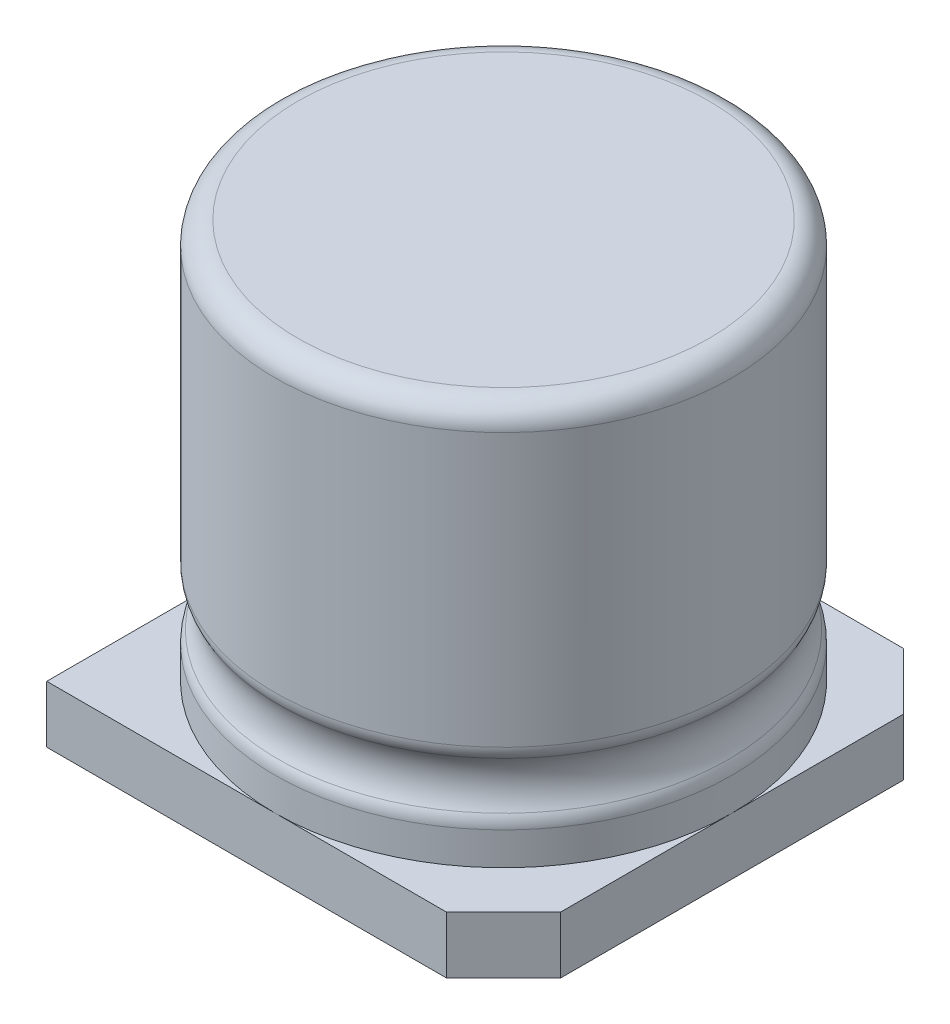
ISO-10303-21;
HEADER;
FILE_DESCRIPTION(('STEP AP214'),'2;1');
FILE_NAME('part.step','',(''),(''),'','','');
FILE_SCHEMA(('AUTOMOTIVE_DESIGN { 1 0 10303 214 1 1 1 1 }'));
ENDSEC;
DATA;
#1=APPLICATION_CONTEXT('core data for automotive mechanical design processes');
#2=APPLICATION_PROTOCOL_DEFINITION('international standard','automotive_design',2000,#1);
#3=PRODUCT_CONTEXT('',#1,'mechanical');
#4=PRODUCT('Part','Part','',(#3));
#5=PRODUCT_RELATED_PRODUCT_CATEGORY('part','',(#4));
#6=PRODUCT_DEFINITION_FORMATION('','',#4);
#7=PRODUCT_DEFINITION_CONTEXT('part definition',#1,'design');
#8=PRODUCT_DEFINITION('design','',#6,#7);
#9=PRODUCT_DEFINITION_SHAPE('','',#8);
#10=(LENGTH_UNIT() NAMED_UNIT(*) SI_UNIT(.MILLI.,.METRE.));
#11=(NAMED_UNIT(*) PLANE_ANGLE_UNIT() SI_UNIT($,.RADIAN.));
#12=(NAMED_UNIT(*) SI_UNIT($,.STERADIAN.) SOLID_ANGLE_UNIT());
#13=UNCERTAINTY_MEASURE_WITH_UNIT(LENGTH_MEASURE(1.E-05),#10,'distance_accuracy_value','');
#14=(GEOMETRIC_REPRESENTATION_CONTEXT(3) GLOBAL_UNCERTAINTY_ASSIGNED_CONTEXT((#13)) GLOBAL_UNIT_ASSIGNED_CONTEXT((#10,
#11,#12)) REPRESENTATION_CONTEXT('',''));
#15=CARTESIAN_POINT('',(0.,0.,0.));
#16=DIRECTION('',(0.,0.,1.));
#17=DIRECTION('',(1.,0.,0.));
#18=AXIS2_PLACEMENT_3D('',#15,#16,#17);
#19=CARTESIAN_POINT('',(18.21688,10.414,-20.7568799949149));
#20=DIRECTION('',(0.,1.,0.));
#21=DIRECTION('',(-1.,0.,0.));
#22=AXIS2_PLACEMENT_3D('',#19,#20,#21);
#23=PLANE('',#22);
#24=CARTESIAN_POINT('',(18.0340000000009,10.414,-16.0020000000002));
#25=CARTESIAN_POINT('',(18.0340001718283,10.414,-15.9747971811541));
#26=CARTESIAN_POINT('',(18.0337574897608,10.4139999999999,-15.9475943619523));
#27=CARTESIAN_POINT('',(18.0327866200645,10.4139999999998,-15.8931973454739));
#28=CARTESIAN_POINT('',(18.0320584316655,10.4139999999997,-15.8660031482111));
#29=CARTESIAN_POINT('',(18.0301167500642,10.4139999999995,-15.8116320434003));
#30=CARTESIAN_POINT('',(18.0289032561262,10.4139999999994,-15.7844551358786));
#31=CARTESIAN_POINT('',(18.0259913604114,10.4139999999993,-15.7301272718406));
#32=CARTESIAN_POINT('',(18.0242929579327,10.4139999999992,-15.7029763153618));
#33=CARTESIAN_POINT('',(18.0204117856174,10.4139999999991,-15.6487090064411));
#34=CARTESIAN_POINT('',(18.0182290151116,10.4139999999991,-15.621592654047));
#35=CARTESIAN_POINT('',(18.0133798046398,10.4139999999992,-15.567403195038));
#36=CARTESIAN_POINT('',(18.0107133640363,10.4139999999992,-15.5403300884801));
#37=CARTESIAN_POINT('',(18.004897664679,10.4139999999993,-15.4862357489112));
#38=CARTESIAN_POINT('',(18.0017484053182,10.4139999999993,-15.4592145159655));
#39=CARTESIAN_POINT('',(17.9949680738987,10.4139999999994,-15.4052325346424));
#40=CARTESIAN_POINT('',(17.9913370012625,10.4139999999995,-15.3782717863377));
#41=CARTESIAN_POINT('',(17.9835942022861,10.4139999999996,-15.3244193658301));
#42=CARTESIAN_POINT('',(17.979482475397,10.4139999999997,-15.2975276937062));
#43=CARTESIAN_POINT('',(17.9707796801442,10.4139999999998,-15.2438219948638));
#44=CARTESIAN_POINT('',(17.9661886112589,10.4139999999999,-15.2170079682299));
#45=CARTESIAN_POINT('',(17.9565285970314,10.4139999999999,-15.1634661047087));
#46=CARTESIAN_POINT('',(17.9514596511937,10.414,-15.1367382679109));
#47=CARTESIAN_POINT('',(17.9408455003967,10.414,-15.0833773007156));
#48=CARTESIAN_POINT('',(17.9353002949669,10.414,-15.0567441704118));
#49=CARTESIAN_POINT('',(17.9237353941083,10.414,-15.0035811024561));
#50=CARTESIAN_POINT('',(17.917715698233,10.414,-14.9770511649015));
#51=CARTESIAN_POINT('',(17.9052037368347,10.4139999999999,-14.9241029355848));
#52=CARTESIAN_POINT('',(17.8987114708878,10.4139999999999,-14.897684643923));
#53=CARTESIAN_POINT('',(17.8852564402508,10.4139999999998,-14.8449681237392));
#54=CARTESIAN_POINT('',(17.8782936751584,10.4139999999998,-14.8186698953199));
#55=CARTESIAN_POINT('',(17.8638998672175,10.4139999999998,-14.7662018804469));
#56=CARTESIAN_POINT('',(17.8564688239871,10.4139999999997,-14.7400320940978));
#57=CARTESIAN_POINT('',(17.8411408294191,10.4139999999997,-14.6878293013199));
#58=CARTESIAN_POINT('',(17.8332438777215,10.4139999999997,-14.6617962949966));
#59=CARTESIAN_POINT('',(17.8169865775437,10.4139999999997,-14.609875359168));
#60=CARTESIAN_POINT('',(17.8086262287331,10.4139999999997,-14.583987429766));
#61=CARTESIAN_POINT('',(17.7914447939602,10.4139999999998,-14.5323648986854));
#62=CARTESIAN_POINT('',(17.7826237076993,10.4139999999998,-14.5066302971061));
#63=CARTESIAN_POINT('',(17.7645236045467,10.4139999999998,-14.4553226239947));
#64=CARTESIAN_POINT('',(17.755244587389,10.4139999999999,-14.4297495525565));
#65=CARTESIAN_POINT('',(17.7362315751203,10.4139999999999,-14.378773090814));
#66=CARTESIAN_POINT('',(17.7264975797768,10.4139999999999,-14.3533697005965));
#67=CARTESIAN_POINT('',(17.7065777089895,10.414,-14.3027406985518));
#68=CARTESIAN_POINT('',(17.6963918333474,10.414,-14.2775150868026));
#69=CARTESIAN_POINT('',(17.6755714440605,10.414,-14.2272496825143));
#70=CARTESIAN_POINT('',(17.6649369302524,10.414,-14.2022098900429));
#71=CARTESIAN_POINT('',(17.6432226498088,10.414,-14.1523241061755));
#72=CARTESIAN_POINT('',(17.6321428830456,10.414,-14.1274781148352));
#73=CARTESIAN_POINT('',(17.6095416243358,10.414,-14.0779878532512));
#74=CARTESIAN_POINT('',(17.598020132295,10.414,-14.0533435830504));
#75=CARTESIAN_POINT('',(17.5745390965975,10.414,-14.0042646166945));
#76=CARTESIAN_POINT('',(17.5625795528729,10.414,-13.9798299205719));
#77=CARTESIAN_POINT('',(17.5382262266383,10.414,-13.9311778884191));
#78=CARTESIAN_POINT('',(17.5258324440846,10.414,-13.9069605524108));
#79=CARTESIAN_POINT('',(17.5006145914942,10.414,-13.8587509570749));
#80=CARTESIAN_POINT('',(17.4877905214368,10.414,-13.8347586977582));
#81=CARTESIAN_POINT('',(17.4617161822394,10.414,-13.7870069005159));
#82=CARTESIAN_POINT('',(17.4484659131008,10.414,-13.7632473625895));
#83=CARTESIAN_POINT('',(17.4215433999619,10.414,-13.7159685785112));
#84=CARTESIAN_POINT('',(17.407871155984,10.414,-13.6924493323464));
#85=CARTESIAN_POINT('',(17.3801090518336,10.414,-13.6456586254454));
#86=CARTESIAN_POINT('',(17.3660191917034,10.414,-13.6223871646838));
#87=CARTESIAN_POINT('',(17.3374263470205,10.414,-13.5760994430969));
#88=CARTESIAN_POINT('',(17.3229233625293,10.414,-13.5530831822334));
#89=CARTESIAN_POINT('',(17.2935088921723,10.414,-13.5073131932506));
#90=CARTESIAN_POINT('',(17.2785974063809,10.414,-13.4845594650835));
#91=CARTESIAN_POINT('',(17.2483706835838,10.414,-13.4393217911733));
#92=CARTESIAN_POINT('',(17.2330554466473,10.414,-13.4168378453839));
#93=CARTESIAN_POINT('',(17.2020261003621,10.414,-13.3721468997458));
#94=CARTESIAN_POINT('',(17.1863119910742,10.414,-13.3499398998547));
#95=CARTESIAN_POINT('',(17.154489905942,10.414,-13.3058099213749));
#96=CARTESIAN_POINT('',(17.1383819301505,10.414,-13.2838869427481));
#97=CARTESIAN_POINT('',(17.1057772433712,10.414,-13.2403319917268));
#98=CARTESIAN_POINT('',(17.0892805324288,10.414,-13.2187000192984));
#99=CARTESIAN_POINT('',(17.0559036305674,10.414,-13.1757339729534));
#100=CARTESIAN_POINT('',(17.0390234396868,10.414,-13.1543998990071));
#101=CARTESIAN_POINT('',(17.0048849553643,10.414,-13.1120364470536));
#102=CARTESIAN_POINT('',(16.987626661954,10.414,-13.0910070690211));
#103=CARTESIAN_POINT('',(16.9527374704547,10.414,-13.049259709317));
#104=CARTESIAN_POINT('',(16.9351065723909,10.414,-13.0285417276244));
#105=CARTESIAN_POINT('',(16.8994777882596,10.414,-12.9874237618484));
#106=CARTESIAN_POINT('',(16.8814799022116,10.414,-12.9670237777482));
#107=CARTESIAN_POINT('',(16.8451228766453,10.414,-12.926548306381));
#108=CARTESIAN_POINT('',(16.8267637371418,10.414,-12.9064728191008));
#109=CARTESIAN_POINT('',(16.7896900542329,10.414,-12.8666527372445));
#110=CARTESIAN_POINT('',(16.7709755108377,10.414,-12.8469081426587));
#111=CARTESIAN_POINT('',(16.7331969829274,10.414,-12.8077561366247));
#112=CARTESIAN_POINT('',(16.7141329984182,10.414,-12.7883487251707));
#113=CARTESIAN_POINT('',(16.675661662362,10.414,-12.7498772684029));
#114=CARTESIAN_POINT('',(16.6562543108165,10.414,-12.7308132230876));
#115=CARTESIAN_POINT('',(16.6171024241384,10.414,-12.6930345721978));
#116=CARTESIAN_POINT('',(16.5973578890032,10.414,-12.6743199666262));
#117=CARTESIAN_POINT('',(16.5575379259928,10.414,-12.6372461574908));
#118=CARTESIAN_POINT('',(16.5374624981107,10.414,-12.6188869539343));
#119=CARTESIAN_POINT('',(16.496987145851,10.414,-12.582529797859));
#120=CARTESIAN_POINT('',(16.4765872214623,10.414,-12.5645318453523));
#121=CARTESIAN_POINT('',(16.435469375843,10.414,-12.5289029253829));
#122=CARTESIAN_POINT('',(16.4147514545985,10.414,-12.5112719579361));
#123=CARTESIAN_POINT('',(16.3730042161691,10.414,-12.4763826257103));
#124=CARTESIAN_POINT('',(16.3519748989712,10.414,-12.4591242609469));
#125=CARTESIAN_POINT('',(16.3096115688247,10.414,-12.4249856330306));
#126=CARTESIAN_POINT('',(16.2882775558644,10.414,-12.4081053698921));
#127=CARTESIAN_POINT('',(16.2453116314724,10.414,-12.3747283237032));
#128=CARTESIAN_POINT('',(16.2236797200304,10.414,-12.3582315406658));
#129=CARTESIAN_POINT('',(16.1801248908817,10.414,-12.3256267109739));
#130=CARTESIAN_POINT('',(16.1582019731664,10.414,-12.3095186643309));
#131=CARTESIAN_POINT('',(16.1140721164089,10.414,-12.2776964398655));
#132=CARTESIAN_POINT('',(16.0918651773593,10.414,-12.2619822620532));
#133=CARTESIAN_POINT('',(16.0471743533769,10.414,-12.2309527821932));
#134=CARTESIAN_POINT('',(16.024690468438,10.414,-12.2156374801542));
#135=CARTESIAN_POINT('',(15.9794529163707,10.414,-12.1854106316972));
#136=CARTESIAN_POINT('',(15.9566992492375,10.414,-12.1704990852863));
#137=CARTESIAN_POINT('',(15.9109293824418,10.414,-12.1410844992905));
#138=CARTESIAN_POINT('',(15.8879131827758,10.414,-12.1265814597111));
#139=CARTESIAN_POINT('',(15.8416255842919,10.414,-12.0979885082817));
#140=CARTESIAN_POINT('',(15.8183541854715,10.414,-12.0838985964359));
#141=CARTESIAN_POINT('',(15.7715636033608,10.414,-12.0561363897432));
#142=CARTESIAN_POINT('',(15.7480444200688,10.414,-12.0424640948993));
#143=CARTESIAN_POINT('',(15.7007657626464,10.414,-12.0155414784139));
#144=CARTESIAN_POINT('',(15.6770062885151,10.414,-12.0022911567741));
#145=CARTESIAN_POINT('',(15.6292546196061,10.414,-11.9762167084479));
#146=CARTESIAN_POINT('',(15.6052624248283,10.414,-11.9633925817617));
#147=CARTESIAN_POINT('',(15.557052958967,10.414,-11.9381746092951));
#148=CARTESIAN_POINT('',(15.5328356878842,10.414,-11.9257807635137));
#149=CARTESIAN_POINT('',(15.4841837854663,10.414,-11.9014273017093));
#150=CARTESIAN_POINT('',(15.4597491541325,10.414,-11.8894676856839));
#151=CARTESIAN_POINT('',(15.4106703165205,10.414,-11.8659864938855));
#152=CARTESIAN_POINT('',(15.3860261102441,10.414,-11.8544649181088));
#153=CARTESIAN_POINT('',(15.3365359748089,10.414,-11.8318634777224));
#154=CARTESIAN_POINT('',(15.3116900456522,10.414,-11.8207836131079));
#155=CARTESIAN_POINT('',(15.2618043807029,10.414,-11.7990691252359));
#156=CARTESIAN_POINT('',(15.2367646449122,10.414,-11.788434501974));
#157=CARTESIAN_POINT('',(15.1864993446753,10.414,-11.7676138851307));
#158=CARTESIAN_POINT('',(15.1612737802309,10.414,-11.7574278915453));
#159=CARTESIAN_POINT('',(15.1106448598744,10.414,-11.7375077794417));
#160=CARTESIAN_POINT('',(15.0852415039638,10.414,-11.7277736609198));
#161=CARTESIAN_POINT('',(15.034265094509,10.414,-11.7087604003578));
#162=CARTESIAN_POINT('',(15.0086920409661,10.414,-11.6994812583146));
#163=CARTESIAN_POINT('',(14.9573843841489,10.414,-11.6813809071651));
#164=CARTESIAN_POINT('',(14.9316497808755,10.414,-11.672559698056));
#165=CARTESIAN_POINT('',(14.8800272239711,10.414,-11.6553780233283));
#166=CARTESIAN_POINT('',(14.8541392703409,10.414,-11.6470175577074));
#167=CARTESIAN_POINT('',(14.802218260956,10.414,-11.6307600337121));
#168=CARTESIAN_POINT('',(14.776185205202,10.414,-11.622862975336));
#169=CARTESIAN_POINT('',(14.7239822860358,10.414,-11.607534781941));
#170=CARTESIAN_POINT('',(14.697812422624,10.414,-11.6001036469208));
#171=CARTESIAN_POINT('',(14.645344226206,10.414,-11.5857096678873));
#172=CARTESIAN_POINT('',(14.6190458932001,10.414,-11.5787468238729));
#173=CARTESIAN_POINT('',(14.56632913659,10.414,-11.5652916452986));
#174=CARTESIAN_POINT('',(14.539910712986,10.414,-11.5587993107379));
#175=CARTESIAN_POINT('',(14.4869621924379,10.414,-11.5462872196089));
#176=CARTESIAN_POINT('',(14.4604320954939,10.414,-11.5402674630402));
#177=CARTESIAN_POINT('',(14.4072686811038,10.414,-11.5287024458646));
#178=CARTESIAN_POINT('',(14.3806353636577,10.414,-11.5231571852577));
#179=CARTESIAN_POINT('',(14.3272739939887,10.414,-11.5125429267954));
#180=CARTESIAN_POINT('',(14.3005459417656,10.414,-11.5074739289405));
#181=CARTESIAN_POINT('',(14.2470036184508,10.414,-11.4978138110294));
#182=CARTESIAN_POINT('',(14.220189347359,10.414,-11.4932226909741));
#183=CARTESIAN_POINT('',(14.1664831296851,10.414,-11.4845197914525));
#184=CARTESIAN_POINT('',(14.1395911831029,10.414,-11.4804080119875));
#185=CARTESIAN_POINT('',(14.0857381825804,10.414,-11.4726651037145));
#186=CARTESIAN_POINT('',(14.0587771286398,10.414,-11.469033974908));
#187=CARTESIAN_POINT('',(14.0047945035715,10.414,-11.4622535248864));
#188=CARTESIAN_POINT('',(13.9777729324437,10.414,-11.4591042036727));
#189=CARTESIAN_POINT('',(13.923677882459,10.414,-11.4532883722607));
#190=CARTESIAN_POINT('',(13.8966044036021,10.414,-11.4506218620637));
#191=CARTESIAN_POINT('',(13.8424141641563,10.414,-11.4457725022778));
#192=CARTESIAN_POINT('',(13.8152974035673,10.414,-11.44358965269));
#193=CARTESIAN_POINT('',(13.7610292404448,10.414,-11.4397083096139));
#194=CARTESIAN_POINT('',(13.7338778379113,10.414,-11.4380098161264));
#195=CARTESIAN_POINT('',(13.6795490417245,10.414,-11.4350977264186));
#196=CARTESIAN_POINT('',(13.6523716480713,10.414,-11.4338841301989));
#197=CARTESIAN_POINT('',(13.5979995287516,10.414,-11.4319422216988));
#198=CARTESIAN_POINT('',(13.5708048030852,10.414,-11.4312139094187));
#199=CARTESIAN_POINT('',(13.5164066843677,10.414,-11.4302428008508));
#200=CARTESIAN_POINT('',(13.4892032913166,10.414,-11.4300000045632));
#201=CARTESIAN_POINT('',(13.4347965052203,10.414,-11.4300000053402));
#202=CARTESIAN_POINT('',(13.407593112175,10.414,-11.4302428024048));
#203=CARTESIAN_POINT('',(13.3531949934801,10.414,-11.4312139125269));
#204=CARTESIAN_POINT('',(13.3260002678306,10.414,-11.4319422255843));
#205=CARTESIAN_POINT('',(13.2716281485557,10.414,-11.4338841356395));
#206=CARTESIAN_POINT('',(13.2444507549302,10.414,-11.4350977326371));
#207=CARTESIAN_POINT('',(13.1901219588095,10.414,-11.4380098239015));
#208=CARTESIAN_POINT('',(13.1629705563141,10.414,-11.4397083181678));
#209=CARTESIAN_POINT('',(13.1087023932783,10.414,-11.4435896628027));
#210=CARTESIAN_POINT('',(13.0815856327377,10.414,-11.4457725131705));
#211=CARTESIAN_POINT('',(13.0273953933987,10.414,-11.4506218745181));
#212=CARTESIAN_POINT('',(13.0003219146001,10.414,-11.4532883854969));
#213=CARTESIAN_POINT('',(12.9462268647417,10.414,-11.4591042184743));
#214=CARTESIAN_POINT('',(12.9192052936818,10.414,-11.4622535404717));
#215=CARTESIAN_POINT('',(12.8652226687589,10.414,-11.4690339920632));
#216=CARTESIAN_POINT('',(12.8382616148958,10.414,-11.472665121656));
#217=CARTESIAN_POINT('',(12.7844086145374,10.414,-11.4804080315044));
#218=CARTESIAN_POINT('',(12.7575166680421,10.414,-11.4845198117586));
#219=CARTESIAN_POINT('',(12.7038104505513,10.414,-11.4932227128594));
#220=CARTESIAN_POINT('',(12.6769961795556,10.414,-11.4978138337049));
#221=CARTESIAN_POINT('',(12.6234538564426,10.414,-11.5074739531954));
#222=CARTESIAN_POINT('',(12.596725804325,10.414,-11.5125429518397));
#223=CARTESIAN_POINT('',(12.543364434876,10.414,-11.5231572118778));
#224=CARTESIAN_POINT('',(12.5167311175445,10.414,-11.5287024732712));
#225=CARTESIAN_POINT('',(12.4635677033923,10.414,-11.5402674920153));
#226=CARTESIAN_POINT('',(12.4370376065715,10.414,-11.5462872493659));
#227=CARTESIAN_POINT('',(12.3840890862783,10.414,-11.5587993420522));
#228=CARTESIAN_POINT('',(12.3576706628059,10.414,-11.5652916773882));
#229=CARTESIAN_POINT('',(12.3049539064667,10.414,-11.578746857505));
#230=CARTESIAN_POINT('',(12.2786555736,10.414,-11.5857097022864));
#231=CARTESIAN_POINT('',(12.2261873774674,10.414,-11.600103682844));
#232=CARTESIAN_POINT('',(12.2000175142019,10.414,-11.6075348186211));
#233=CARTESIAN_POINT('',(12.1478145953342,10.414,-11.622863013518));
#234=CARTESIAN_POINT('',(12.1217815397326,10.414,-11.6307600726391));
#235=CARTESIAN_POINT('',(12.0698605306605,10.414,-11.6470175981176));
#236=CARTESIAN_POINT('',(12.0439725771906,10.414,-11.6553780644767));
#237=CARTESIAN_POINT('',(11.9923500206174,10.414,-11.6725597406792));
#238=CARTESIAN_POINT('',(11.9666154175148,10.414,-11.6813809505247));
#239=CARTESIAN_POINT('',(11.9153077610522,10.414,-11.6994813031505));
#240=CARTESIAN_POINT('',(11.8897347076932,10.414,-11.7087604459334));
#241=CARTESIAN_POINT('',(11.8387582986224,10.414,-11.7277737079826));
#242=CARTESIAN_POINT('',(11.8133549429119,10.414,-11.7375078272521));
#243=CARTESIAN_POINT('',(11.7627260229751,10.414,-11.7574279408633));
#244=CARTESIAN_POINT('',(11.7375004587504,10.414,-11.7676139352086));
#245=CARTESIAN_POINT('',(11.6872351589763,10.414,-11.7884345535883));
#246=CARTESIAN_POINT('',(11.6621954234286,10.414,-11.7990691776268));
#247=CARTESIAN_POINT('',(11.6123097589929,10.414,-11.8207836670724));
#248=CARTESIAN_POINT('',(11.5874638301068,10.414,-11.831863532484));
#249=CARTESIAN_POINT('',(11.5379736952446,10.414,-11.8544649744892));
#250=CARTESIAN_POINT('',(11.5133294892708,10.414,-11.8659865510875));
#251=CARTESIAN_POINT('',(11.4642506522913,10.414,-11.8894677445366));
#252=CARTESIAN_POINT('',(11.4398160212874,10.414,-11.9014273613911));
#253=CARTESIAN_POINT('',(11.3911641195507,10.414,-11.9257808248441));
#254=CARTESIAN_POINT('',(11.3669468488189,10.414,-11.9381746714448));
#255=CARTESIAN_POINT('',(11.318737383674,10.414,-11.9633926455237));
#256=CARTESIAN_POINT('',(11.2947451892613,10.414,-11.9762167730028));
#257=CARTESIAN_POINT('',(11.2469935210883,10.414,-12.0022912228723));
#258=CARTESIAN_POINT('',(11.2232340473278,10.414,-12.0155415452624));
#259=CARTESIAN_POINT('',(11.1759553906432,10.414,-12.0424641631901));
#260=CARTESIAN_POINT('',(11.1524362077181,10.414,-12.0561364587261));
#261=CARTESIAN_POINT('',(11.105645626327,10.414,-12.0838986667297));
#262=CARTESIAN_POINT('',(11.082374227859,10.414,-12.0979885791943));
#263=CARTESIAN_POINT('',(11.0360866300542,10.414,-12.1265815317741));
#264=CARTESIAN_POINT('',(11.0130704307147,10.414,-12.1410845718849));
#265=CARTESIAN_POINT('',(10.9673005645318,10.414,-12.1704991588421));
#266=CARTESIAN_POINT('',(10.9445468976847,10.414,-12.1854107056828));
#267=CARTESIAN_POINT('',(10.8993093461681,10.414,-12.2156375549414));
#268=CARTESIAN_POINT('',(10.8768254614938,10.414,-12.2309528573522));
#269=CARTESIAN_POINT('',(10.8321346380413,10.414,-12.261982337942));
#270=CARTESIAN_POINT('',(10.809927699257,10.414,-12.2776965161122));
#271=CARTESIAN_POINT('',(10.7657978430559,10.414,-12.3095187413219));
#272=CARTESIAN_POINT('',(10.7438749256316,10.414,-12.3256267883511));
#273=CARTESIAN_POINT('',(10.700320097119,10.414,-12.3582316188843));
#274=CARTESIAN_POINT('',(10.678688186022,10.414,-12.3747284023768));
#275=CARTESIAN_POINT('',(10.6357222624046,10.414,-12.4081054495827));
#276=CARTESIAN_POINT('',(10.6143882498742,10.414,-12.4249857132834));
#277=CARTESIAN_POINT('',(10.5720249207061,10.414,-12.4591243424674));
#278=CARTESIAN_POINT('',(10.5509956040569,10.414,-12.4763827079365));
#279=CARTESIAN_POINT('',(10.5092483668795,10.414,-12.5112720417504));
#280=CARTESIAN_POINT('',(10.4885304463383,10.414,-12.5289030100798));
#281=CARTESIAN_POINT('',(10.4474126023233,10.414,-12.5645319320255));
#282=CARTESIAN_POINT('',(10.4270126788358,10.414,-12.5825298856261));
#283=CARTESIAN_POINT('',(10.3865373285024,10.414,-12.6188870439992));
#284=CARTESIAN_POINT('',(10.3664619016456,10.414,-12.6372462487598));
#285=CARTESIAN_POINT('',(10.3266419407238,10.414,-12.6743200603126));
#286=CARTESIAN_POINT('',(10.3068974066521,10.414,-12.6930346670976));
#287=CARTESIAN_POINT('',(10.267745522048,10.414,-12.7308133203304));
#288=CARTESIAN_POINT('',(10.2483381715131,10.414,-12.7498773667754));
#289=CARTESIAN_POINT('',(10.2098668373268,10.414,-12.7883488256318));
#290=CARTESIAN_POINT('',(10.1908028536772,10.414,-12.8077562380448));
#291=CARTESIAN_POINT('',(10.1530243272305,10.414,-12.8469082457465));
#292=CARTESIAN_POINT('',(10.1343097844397,10.414,-12.866652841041));
#293=CARTESIAN_POINT('',(10.097236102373,10.414,-12.9064729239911));
#294=CARTESIAN_POINT('',(10.0788769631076,10.414,-12.9265484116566));
#295=CARTESIAN_POINT('',(10.0425199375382,10.414,-12.9670238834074));
#296=CARTESIAN_POINT('',(10.0245220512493,10.414,-12.9874238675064));
#297=CARTESIAN_POINT('',(9.98889326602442,10.414,-13.0285418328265));
#298=CARTESIAN_POINT('',(9.97126236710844,10.414,-13.049259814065));
#299=CARTESIAN_POINT('',(9.93637317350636,10.414,-13.0910071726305));
#300=CARTESIAN_POINT('',(9.91911487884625,10.414,-13.1120365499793));
#301=CARTESIAN_POINT('',(9.88497639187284,10.414,-13.154400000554));
#302=CARTESIAN_POINT('',(9.86809619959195,10.414,-13.1757340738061));
#303=CARTESIAN_POINT('',(9.8347192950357,10.414,-13.218700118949));
#304=CARTESIAN_POINT('',(9.81822258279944,10.414,-13.2403320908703));
#305=CARTESIAN_POINT('',(9.78561789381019,10.414,-13.2838870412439));
#306=CARTESIAN_POINT('',(9.76950991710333,10.414,-13.3058100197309));
#307=CARTESIAN_POINT('',(9.73768783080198,10.414,-13.3499399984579));
#308=CARTESIAN_POINT('',(9.72197372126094,10.414,-13.3721469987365));
#309=CARTESIAN_POINT('',(9.6909443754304,10.414,-13.4168379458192));
#310=CARTESIAN_POINT('',(9.67562913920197,10.414,-13.4393218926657));
#311=CARTESIAN_POINT('',(9.64540241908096,10.414,-13.4845595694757));
#312=CARTESIAN_POINT('',(9.63049093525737,10.414,-13.5073132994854));
#313=CARTESIAN_POINT('',(9.60107647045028,10.414,-13.5530832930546));
#314=CARTESIAN_POINT('',(9.5865734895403,10.414,-13.5760995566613));
#315=CARTESIAN_POINT('',(9.5579806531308,10.414,-13.6223872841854));
#316=CARTESIAN_POINT('',(9.5438907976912,10.414,-13.6456587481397));
#317=CARTESIAN_POINT('',(9.51612870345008,10.414,-13.6924494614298));
#318=CARTESIAN_POINT('',(9.50245646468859,10.414,-13.7159687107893));
#319=CARTESIAN_POINT('',(9.47553396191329,10.414,-13.7632475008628));
#320=CARTESIAN_POINT('',(9.46228369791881,10.414,-13.7870070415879));
#321=CARTESIAN_POINT('',(9.43620936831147,10.414,-13.8347588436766));
#322=CARTESIAN_POINT('',(9.42338530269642,10.414,-13.8587511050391));
#323=CARTESIAN_POINT('',(9.39816745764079,10.414,-13.9069607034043));
#324=CARTESIAN_POINT('',(9.38577367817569,10.414,-13.9311780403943));
#325=CARTESIAN_POINT('',(9.36142035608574,10.414,-13.9798300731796));
#326=CARTESIAN_POINT('',(9.34946081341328,10.414,-14.0042647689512));
#327=CARTESIAN_POINT('',(9.32597977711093,10.414,-14.0533437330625));
#328=CARTESIAN_POINT('',(9.31445828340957,10.414,-14.077988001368));
#329=CARTESIAN_POINT('',(9.29185701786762,10.414,-14.1274782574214));
#330=CARTESIAN_POINT('',(9.28077724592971,10.414,-14.152324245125));
#331=CARTESIAN_POINT('',(9.2590629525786,10.414,-14.2022100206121));
#332=CARTESIAN_POINT('',(9.24842843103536,10.414,-14.2272498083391));
#333=CARTESIAN_POINT('',(9.22760802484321,10.414,-14.2775152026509));
#334=CARTESIAN_POINT('',(9.2174221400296,10.414,-14.3027408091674));
#335=CARTESIAN_POINT('',(9.19750225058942,10.414,-14.3533698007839));
#336=CARTESIAN_POINT('',(9.18776824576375,10.414,-14.3787731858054));
#337=CARTESIAN_POINT('',(9.16875521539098,10.414,-14.4297496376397));
#338=CARTESIAN_POINT('',(9.15947618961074,10.4139999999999,-14.4553227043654));
#339=CARTESIAN_POINT('',(9.14137607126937,10.4139999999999,-14.5066303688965));
#340=CARTESIAN_POINT('',(9.13255497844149,10.4139999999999,-14.5323649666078));
#341=CARTESIAN_POINT('',(9.1153735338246,10.4139999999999,-14.5839874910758));
#342=CARTESIAN_POINT('',(9.10701318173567,10.4139999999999,-14.6098754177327));
#343=CARTESIAN_POINT('',(9.09075587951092,10.4139999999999,-14.6617963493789));
#344=CARTESIAN_POINT('',(9.0828589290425,10.4139999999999,-14.6878293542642));
#345=CARTESIAN_POINT('',(9.06753094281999,10.4139999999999,-14.7400321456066));
#346=CARTESIAN_POINT('',(9.06009990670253,10.4139999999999,-14.7662019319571));
#347=CARTESIAN_POINT('',(9.04570611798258,10.4139999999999,-14.8186699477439));
#348=CARTESIAN_POINT('',(9.03874336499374,10.4139999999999,-14.8449681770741));
#349=CARTESIAN_POINT('',(9.02528836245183,10.414,-14.8976846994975));
#350=CARTESIAN_POINT('',(9.01879611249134,10.414,-14.9241029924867));
#351=CARTESIAN_POINT('',(9.00628418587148,10.414,-14.9770512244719));
#352=CARTESIAN_POINT('',(9.0002645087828,10.414,-15.0035811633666));
#353=CARTESIAN_POINT('',(8.98869964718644,10.414,-15.0567442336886));
#354=CARTESIAN_POINT('',(8.98315446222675,10.414,-15.0833773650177));
#355=CARTESIAN_POINT('',(8.97254035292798,10.414,-15.136738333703));
#356=CARTESIAN_POINT('',(8.96747142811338,10.414,-15.1634661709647));
#357=CARTESIAN_POINT('',(8.95781145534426,10.4139999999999,-15.2170080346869));
#358=CARTESIAN_POINT('',(8.95322040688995,10.4139999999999,-15.2438220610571));
#359=CARTESIAN_POINT('',(8.94451765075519,10.4139999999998,-15.2975277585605));
#360=CARTESIAN_POINT('',(8.94040594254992,10.4139999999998,-15.3244194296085));
#361=CARTESIAN_POINT('',(8.93266317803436,10.4139999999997,-15.3782718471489));
#362=CARTESIAN_POINT('',(8.92903212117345,10.4139999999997,-15.4052325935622));
#363=CARTESIAN_POINT('',(8.92225181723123,10.4139999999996,-15.4592145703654));
#364=CARTESIAN_POINT('',(8.91910256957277,10.4139999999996,-15.4862358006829));
#365=CARTESIAN_POINT('',(8.91328688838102,10.4139999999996,-15.5403301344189));
#366=CARTESIAN_POINT('',(8.91062045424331,10.4139999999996,-15.5674032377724));
#367=CARTESIAN_POINT('',(8.90577125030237,10.4139999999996,-15.621592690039));
#368=CARTESIAN_POINT('',(8.90358847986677,10.4139999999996,-15.6487090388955));
#369=CARTESIAN_POINT('',(8.89970730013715,10.4139999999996,-15.7029763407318));
#370=CARTESIAN_POINT('',(8.89800889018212,10.4139999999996,-15.7301272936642));
#371=CARTESIAN_POINT('',(8.8950969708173,10.4139999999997,-15.7844551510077));
#372=CARTESIAN_POINT('',(8.89388346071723,10.4139999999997,-15.8116320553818));
#373=CARTESIAN_POINT('',(8.89194173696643,10.4139999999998,-15.8660031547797));
#374=CARTESIAN_POINT('',(8.89121352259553,10.4139999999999,-15.8931973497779));
#375=CARTESIAN_POINT('',(8.89024259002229,10.414,-15.9475943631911));
#376=CARTESIAN_POINT('',(8.88999987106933,10.414,-15.9747971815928));
#377=CARTESIAN_POINT('',(8.88999999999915,10.414,-16.001999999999));
#378=B_SPLINE_CURVE_WITH_KNOTS('',3,(#24,#25,#26,#27,#28,#29,#30,#31,#32,#33,#34,#35,#36,#37,
#38,#39,#40,#41,#42,#43,#44,#45,#46,#47,#48,#49,#50,#51,#52,#53,#54,#55,#56,#57,#58,#59,#60,#61,
#62,#63,#64,#65,#66,#67,#68,#69,#70,#71,#72,#73,#74,#75,#76,#77,#78,#79,#80,#81,#82,#83,#84,#85,
#86,#87,#88,#89,#90,#91,#92,#93,#94,#95,#96,#97,#98,#99,#100,#101,#102,#103,#104,#105,#106,#107,
#108,#109,#110,#111,#112,#113,#114,#115,#116,#117,#118,#119,#120,#121,#122,#123,#124,#125,#126,
#127,#128,#129,#130,#131,#132,#133,#134,#135,#136,#137,#138,#139,#140,#141,#142,#143,#144,#145,
#146,#147,#148,#149,#150,#151,#152,#153,#154,#155,#156,#157,#158,#159,#160,#161,#162,#163,#164,
#165,#166,#167,#168,#169,#170,#171,#172,#173,#174,#175,#176,#177,#178,#179,#180,#181,#182,#183,
#184,#185,#186,#187,#188,#189,#190,#191,#192,#193,#194,#195,#196,#197,#198,#199,#200,#201,#202,
#203,#204,#205,#206,#207,#208,#209,#210,#211,#212,#213,#214,#215,#216,#217,#218,#219,#220,#221,
#222,#223,#224,#225,#226,#227,#228,#229,#230,#231,#232,#233,#234,#235,#236,#237,#238,#239,#240,
#241,#242,#243,#244,#245,#246,#247,#248,#249,#250,#251,#252,#253,#254,#255,#256,#257,#258,#259,
#260,#261,#262,#263,#264,#265,#266,#267,#268,#269,#270,#271,#272,#273,#274,#275,#276,#277,#278,
#279,#280,#281,#282,#283,#284,#285,#286,#287,#288,#289,#290,#291,#292,#293,#294,#295,#296,#297,
#298,#299,#300,#301,#302,#303,#304,#305,#306,#307,#308,#309,#310,#311,#312,#313,#314,#315,#316,
#317,#318,#319,#320,#321,#322,#323,#324,#325,#326,#327,#328,#329,#330,#331,#332,#333,#334,#335,
#336,#337,#338,#339,#340,#341,#342,#343,#344,#345,#346,#347,#348,#349,#350,#351,#352,#353,#354,
#355,#356,#357,#358,#359,#360,#361,#362,#363,#364,#365,#366,#367,#368,#369,#370,#371,#372,#373,
#374,#375,#376,#377),.UNSPECIFIED.,.F.,.F.,(4,2,2,2,2,2,2,2,2,2,2,2,2,2,2,2,2,2,2,2,2,2,2,2,2,2,
2,2,2,2,2,2,2,2,2,2,2,2,2,2,2,2,2,2,2,2,2,2,2,2,2,2,2,2,2,2,2,2,2,2,2,2,2,2,2,2,2,2,2,2,2,2,2,2,
2,2,2,2,2,2,2,2,2,2,2,2,2,2,2,2,2,2,2,2,2,2,2,2,2,2,2,2,2,2,2,2,2,2,2,2,2,2,2,2,2,2,2,2,2,2,2,2,
2,2,2,2,2,2,2,2,2,2,2,2,2,2,2,2,2,2,2,2,2,2,2,2,2,2,2,2,2,2,2,2,2,2,2,2,2,2,2,2,2,2,2,2,2,2,2,2,
2,2,2,2,2,2,4),(0.,0.0816073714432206,0.163214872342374,0.244822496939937,0.326430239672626,
0.40803809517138,0.489646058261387,0.5712541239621,0.652862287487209,0.7344705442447,
0.81607888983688,0.897687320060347,0.979295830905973,1.06090441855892,1.14251307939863,
1.22412180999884,1.30573060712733,1.38733946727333,1.46894838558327,1.5505573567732,
1.63216637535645,1.71377543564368,1.79538453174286,1.87699365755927,1.95860280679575,
2.0402119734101,2.12182115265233,2.20343034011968,2.28503953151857,2.36664872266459,
2.44825790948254,2.52986708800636,2.61147625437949,2.69308540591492,2.77469454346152,
2.8563036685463,2.93791278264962,3.01952188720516,3.10113098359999,3.18274007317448,
3.26434915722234,3.34595823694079,3.42756731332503,3.50917638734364,3.59078545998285,
3.67239453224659,3.75400360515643,3.83561267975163,3.91722175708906,3.99883083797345,
4.08043992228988,4.16204900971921,4.24365809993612,4.3252671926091,4.40687628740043,
4.48848538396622,4.57009448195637,4.65170358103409,4.73331268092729,4.81492178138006,
4.89653088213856,4.97813998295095,5.05974908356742,5.14135818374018,5.22296728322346,
5.30457638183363,5.38618547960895,5.46779457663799,5.54940367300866,5.63101276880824,
5.71262186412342,5.79423095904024,5.87584005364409,5.95744914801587,6.03905824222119,
6.12066733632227,6.20227643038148,6.28388552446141,6.3654946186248,6.44710371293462,
6.52871280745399,6.61032190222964,6.69193099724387,6.77354009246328,6.85514918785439,
6.93675828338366,7.01836737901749,7.09997647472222,7.18158557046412,7.26319466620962,
7.34480376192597,7.42641285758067,7.50802195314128,7.58963104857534,7.67124014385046,
7.7528492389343,7.83445833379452,7.91606742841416,7.99767652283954,8.07928561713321,
8.16089471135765,8.24250380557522,8.32411289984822,8.40572199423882,8.48733108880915,
8.56894018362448,8.65054927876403,8.73215837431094,8.8137674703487,8.89537656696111,
8.97698566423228,9.05859476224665,9.14020386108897,9.2218129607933,9.30342206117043,
9.38503116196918,9.46664026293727,9.54824936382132,9.62985846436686,9.71146756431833,
9.79307666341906,9.87468576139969,9.95629485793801,10.0379039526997,10.1195130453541,
10.2011221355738,10.2827312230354,10.3643403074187,10.4459493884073,10.5275584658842,
10.6091675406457,10.6907766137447,10.7723856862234,10.8539947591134,10.9356038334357,
11.0172129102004,11.0988219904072,11.180431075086,11.2620401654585,11.3436492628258,
11.4252583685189,11.5068674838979,11.5884766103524,11.6700857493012,11.7516949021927,
11.833304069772,11.9149132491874,11.9965224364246,12.0781316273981,12.159740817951,
12.2413500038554,12.3229591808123,12.4045683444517,12.48617749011,12.5677866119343,
12.6493957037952,12.7310047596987,12.8126137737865,12.894222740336,12.9758316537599,
13.0574405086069,13.1390492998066,13.2206580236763,13.3022666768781,13.3838752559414,
13.465483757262,13.547092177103,13.628700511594,13.7103087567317,13.7919169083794,
13.8735249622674,13.955132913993,14.0367407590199,14.1183484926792,14.1999561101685,
14.2815636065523,14.3631709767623),.UNSPECIFIED.);
#379=CARTESIAN_POINT('',(8.88999999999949,10.414,-16.0019999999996));
#380=VERTEX_POINT('',#379);
#381=CARTESIAN_POINT('',(18.0340000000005,10.414,-16.0020000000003));
#382=VERTEX_POINT('',#381);
#383=EDGE_CURVE('E185',#380,#382,#378,.F.);
#384=ORIENTED_EDGE('',*,*,#383,.T.);
#385=CARTESIAN_POINT('',(13.462,10.414,-16.002));
#386=DIRECTION('',(0.,-1.,0.));
#387=DIRECTION('',(-1.,0.,0.));
#388=AXIS2_PLACEMENT_3D('',#385,#386,#387);
#389=CIRCLE('',#388,4.57200000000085);
#390=EDGE_CURVE('E231',#382,#380,#389,.F.);
#391=ORIENTED_EDGE('',*,*,#390,.T.);
#392=EDGE_LOOP('',(#384,#391));
#393=FACE_BOUND('',#392,.T.);
#394=ADVANCED_FACE('F15',(#393),#23,.T.);
#395=CARTESIAN_POINT('',(13.462,9.906,-16.002));
#396=DIRECTION('',(0.,1.,0.));
#397=DIRECTION('',(-0.999985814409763,0.,-0.00532644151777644));
#398=AXIS2_PLACEMENT_3D('',#395,#396,#397);
#399=TOROIDAL_SURFACE('',#398,4.57200000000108,0.508);
#400=CARTESIAN_POINT('',(13.462,9.90599999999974,-16.002));
#401=DIRECTION('',(0.,1.,0.));
#402=DIRECTION('',(-1.,0.,0.));
#403=AXIS2_PLACEMENT_3D('',#400,#401,#402);
#404=CIRCLE('',#403,5.08);
#405=CARTESIAN_POINT('',(8.382,9.90599999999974,-16.002));
#406=VERTEX_POINT('',#405);
#407=EDGE_CURVE('E232',#406,#406,#404,.T.);
#408=ORIENTED_EDGE('',*,*,#407,.T.);
#409=EDGE_LOOP('',(#408));
#410=FACE_BOUND('',#409,.T.);
#411=ORIENTED_EDGE('',*,*,#390,.F.);
#412=ORIENTED_EDGE('',*,*,#383,.F.);
#413=EDGE_LOOP('',(#411,#412));
#414=FACE_BOUND('',#413,.T.);
#415=ADVANCED_FACE('F192',(#410,#414),#399,.T.);
#416=CARTESIAN_POINT('',(13.462,3.84359751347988,-16.002));
#417=DIRECTION('',(0.,1.,0.));
#418=DIRECTION('',(0.,0.,1.));
#419=AXIS2_PLACEMENT_3D('',#416,#417,#418);
#420=CYLINDRICAL_SURFACE('',#419,5.08);
#421=CARTESIAN_POINT('',(13.462,3.84359751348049,-16.002));
#422=DIRECTION('',(0.,1.,0.));
#423=DIRECTION('',(-0.999984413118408,0.,-0.00558332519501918));
#424=AXIS2_PLACEMENT_3D('',#421,#422,#423);
#425=CIRCLE('',#424,5.07999999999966);
#426=CARTESIAN_POINT('',(8.38207918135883,3.84359751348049,-16.0303632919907));
#427=VERTEX_POINT('',#426);
#428=EDGE_CURVE('E181',#427,#427,#425,.T.);
#429=ORIENTED_EDGE('',*,*,#428,.T.);
#430=EDGE_LOOP('',(#429));
#431=FACE_BOUND('',#430,.T.);
#432=ORIENTED_EDGE('',*,*,#407,.F.);
#433=EDGE_LOOP('',(#432));
#434=FACE_BOUND('',#433,.T.);
#435=ADVANCED_FACE('F201',(#431,#434),#420,.T.);
#436=CARTESIAN_POINT('',(13.462,3.84359751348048,-16.002));
#437=DIRECTION('',(0.,1.,0.));
#438=DIRECTION('',(-0.999984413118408,0.,-0.00558332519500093));
#439=AXIS2_PLACEMENT_3D('',#436,#437,#438);
#440=TOROIDAL_SURFACE('',#439,4.57199999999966,0.508);
#441=CARTESIAN_POINT('',(13.462,3.57640579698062,-16.002));
#442=DIRECTION('',(0.,-1.,0.));
#443=DIRECTION('',(1.,0.,0.));
#444=AXIS2_PLACEMENT_3D('',#441,#442,#443);
#445=CIRCLE('',#444,5.00405623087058);
#446=CARTESIAN_POINT('',(18.4660562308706,3.57640579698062,-16.002));
#447=VERTEX_POINT('',#446);
#448=EDGE_CURVE('E99',#447,#447,#445,.T.);
#449=ORIENTED_EDGE('',*,*,#448,.F.);
#450=EDGE_LOOP('',(#449));
#451=FACE_BOUND('',#450,.T.);
#452=ORIENTED_EDGE('',*,*,#428,.F.);
#453=EDGE_LOOP('',(#452));
#454=FACE_BOUND('',#453,.T.);
#455=ADVANCED_FACE('F154',(#451,#454),#440,.T.);
#456=CARTESIAN_POINT('',(18.7452,1.524,-10.7188));
#457=DIRECTION('',(0.,-1.,0.));
#458=DIRECTION('',(-1.,0.,0.));
#459=AXIS2_PLACEMENT_3D('',#456,#457,#458);
#460=PLANE('',#459);
#461=DIRECTION('',(0.707106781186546,0.,0.707106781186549));
#462=VECTOR('',#461,1.);
#463=CARTESIAN_POINT('',(17.907,1.524,-20.447));
#464=LINE('',#463,#462);
#465=CARTESIAN_POINT('',(17.272,1.524,-21.082));
#466=VERTEX_POINT('',#465);
#467=CARTESIAN_POINT('',(18.542,1.524,-19.812));
#468=VERTEX_POINT('',#467);
#469=EDGE_CURVE('E114',#466,#468,#464,.T.);
#470=ORIENTED_EDGE('',*,*,#469,.F.);
#471=DIRECTION('',(1.,0.,0.));
#472=VECTOR('',#471,1.);
#473=CARTESIAN_POINT('',(12.827,1.524,-21.082));
#474=LINE('',#473,#472);
#475=CARTESIAN_POINT('',(13.4619999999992,1.524,-21.082));
#476=VERTEX_POINT('',#475);
#477=EDGE_CURVE('E112',#476,#466,#474,.T.);
#478=ORIENTED_EDGE('',*,*,#477,.F.);
#479=CARTESIAN_POINT('',(13.462,1.52400000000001,-16.002));
#480=DIRECTION('',(0.,1.,0.));
#481=DIRECTION('',(0.,0.,1.));
#482=AXIS2_PLACEMENT_3D('',#479,#480,#481);
#483=CIRCLE('',#482,5.08);
#484=CARTESIAN_POINT('',(18.542,1.524,-16.0020000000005));
#485=VERTEX_POINT('',#484);
#486=EDGE_CURVE('E85',#476,#485,#483,.F.);
#487=ORIENTED_EDGE('',*,*,#486,.T.);
#488=DIRECTION('',(0.,0.,1.));
#489=VECTOR('',#488,1.);
#490=CARTESIAN_POINT('',(18.542,1.524,-16.002));
#491=LINE('',#490,#489);
#492=EDGE_CURVE('E287',#468,#485,#491,.T.);
#493=ORIENTED_EDGE('',*,*,#492,.F.);
#494=EDGE_LOOP('',(#470,#478,#487,#493));
#495=FACE_BOUND('',#494,.T.);
#496=ADVANCED_FACE('F113',(#495),#460,.F.);
#497=CARTESIAN_POINT('',(13.462,3.048,-16.002));
#498=DIRECTION('',(0.,-1.,0.));
#499=DIRECTION('',(1.,0.,0.));
#500=AXIS2_PLACEMENT_3D('',#497,#498,#499);
#501=TOROIDAL_SURFACE('',#500,5.85850269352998,1.00463498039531);
#502=CARTESIAN_POINT('',(13.462,2.51959420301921,-16.002));
#503=DIRECTION('',(0.,1.,0.));
#504=DIRECTION('',(0.999986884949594,0.,-0.00512151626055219));
#505=AXIS2_PLACEMENT_3D('',#502,#503,#504);
#506=CIRCLE('',#505,5.00405623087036);
#507=CARTESIAN_POINT('',(18.4659906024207,2.51959420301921,-16.0276283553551));
#508=VERTEX_POINT('',#507);
#509=EDGE_CURVE('E136',#508,#508,#506,.T.);
#510=ORIENTED_EDGE('',*,*,#509,.T.);
#511=EDGE_LOOP('',(#510));
#512=FACE_BOUND('',#511,.T.);
#513=ORIENTED_EDGE('',*,*,#448,.T.);
#514=EDGE_LOOP('',(#513));
#515=FACE_BOUND('',#514,.T.);
#516=ADVANCED_FACE('F148',(#512,#515),#501,.F.);
#517=CARTESIAN_POINT('',(17.2466,0.2286,-10.8966));
#518=DIRECTION('',(0.707106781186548,0.,0.707106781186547));
#519=DIRECTION('',(0.707106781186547,0.,-0.707106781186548));
#520=AXIS2_PLACEMENT_3D('',#517,#518,#519);
#521=PLANE('',#520);
#522=DIRECTION('',(-0.707106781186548,0.,0.707106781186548));
#523=VECTOR('',#522,1.);
#524=CARTESIAN_POINT('',(18.542,0.254,-12.192));
#525=LINE('',#524,#523);
#526=CARTESIAN_POINT('',(18.542,0.254,-12.192));
#527=VERTEX_POINT('',#526);
#528=CARTESIAN_POINT('',(17.272,0.254,-10.922));
#529=VERTEX_POINT('',#528);
#530=EDGE_CURVE('E122',#527,#529,#525,.T.);
#531=ORIENTED_EDGE('',*,*,#530,.F.);
#532=DIRECTION('',(0.,-1.,0.));
#533=VECTOR('',#532,1.);
#534=CARTESIAN_POINT('',(18.542,0.889,-12.192));
#535=LINE('',#534,#533);
#536=CARTESIAN_POINT('',(18.542,1.524,-12.192));
#537=VERTEX_POINT('',#536);
#538=EDGE_CURVE('E165',#537,#527,#535,.T.);
#539=ORIENTED_EDGE('',*,*,#538,.F.);
#540=DIRECTION('',(0.707106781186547,0.,-0.707106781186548));
#541=VECTOR('',#540,1.);
#542=CARTESIAN_POINT('',(17.2466,1.524,-10.8966));
#543=LINE('',#542,#541);
#544=CARTESIAN_POINT('',(17.272,1.524,-10.922));
#545=VERTEX_POINT('',#544);
#546=EDGE_CURVE('E109',#537,#545,#543,.F.);
#547=ORIENTED_EDGE('',*,*,#546,.T.);
#548=DIRECTION('',(0.,-1.,0.));
#549=VECTOR('',#548,1.);
#550=CARTESIAN_POINT('',(17.2719999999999,0.889,-10.9219999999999));
#551=LINE('',#550,#549);
#552=EDGE_CURVE('E98',#545,#529,#551,.T.);
#553=ORIENTED_EDGE('',*,*,#552,.T.);
#554=EDGE_LOOP('',(#531,#539,#547,#553));
#555=FACE_BOUND('',#554,.T.);
#556=ADVANCED_FACE('F152',(#555),#521,.T.);
#557=CARTESIAN_POINT('',(8.2042,1.5494,-21.082));
#558=DIRECTION('',(0.,0.,-1.));
#559=DIRECTION('',(1.,0.,0.));
#560=AXIS2_PLACEMENT_3D('',#557,#558,#559);
#561=PLANE('',#560);
#562=DIRECTION('',(1.,0.,0.));
#563=VECTOR('',#562,1.);
#564=CARTESIAN_POINT('',(13.462,0.254,-21.082));
#565=LINE('',#564,#563);
#566=CARTESIAN_POINT('',(8.382,0.254,-21.082));
#567=VERTEX_POINT('',#566);
#568=CARTESIAN_POINT('',(17.272,0.254,-21.082));
#569=VERTEX_POINT('',#568);
#570=EDGE_CURVE('E125',#567,#569,#565,.T.);
#571=ORIENTED_EDGE('',*,*,#570,.F.);
#572=DIRECTION('',(0.,1.,0.));
#573=VECTOR('',#572,1.);
#574=CARTESIAN_POINT('',(8.382,0.889,-21.082));
#575=LINE('',#574,#573);
#576=CARTESIAN_POINT('',(8.382,1.524,-21.082));
#577=VERTEX_POINT('',#576);
#578=EDGE_CURVE('E118',#567,#577,#575,.T.);
#579=ORIENTED_EDGE('',*,*,#578,.T.);
#580=DIRECTION('',(1.,0.,0.));
#581=VECTOR('',#580,1.);
#582=CARTESIAN_POINT('',(13.462,1.524,-21.082));
#583=LINE('',#582,#581);
#584=EDGE_CURVE('E106',#577,#476,#583,.T.);
#585=ORIENTED_EDGE('',*,*,#584,.T.);
#586=ORIENTED_EDGE('',*,*,#477,.T.);
#587=DIRECTION('',(0.,1.,0.));
#588=VECTOR('',#587,1.);
#589=CARTESIAN_POINT('',(17.272,0.889,-21.0820000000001));
#590=LINE('',#589,#588);
#591=EDGE_CURVE('E169',#569,#466,#590,.T.);
#592=ORIENTED_EDGE('',*,*,#591,.F.);
#593=EDGE_LOOP('',(#571,#579,#585,#586,#592));
#594=FACE_BOUND('',#593,.T.);
#595=ADVANCED_FACE('F121',(#594),#561,.T.);
#596=CARTESIAN_POINT('',(18.5674,0.2286,-19.7866));
#597=DIRECTION('',(0.707106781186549,0.,-0.707106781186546));
#598=DIRECTION('',(-0.707106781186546,0.,-0.707106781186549));
#599=AXIS2_PLACEMENT_3D('',#596,#597,#598);
#600=PLANE('',#599);
#601=DIRECTION('',(0.707106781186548,0.,0.707106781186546));
#602=VECTOR('',#601,1.);
#603=CARTESIAN_POINT('',(17.272,0.254,-21.082));
#604=LINE('',#603,#602);
#605=CARTESIAN_POINT('',(18.542,0.254,-19.812));
#606=VERTEX_POINT('',#605);
#607=EDGE_CURVE('E228',#569,#606,#604,.T.);
#608=ORIENTED_EDGE('',*,*,#607,.F.);
#609=ORIENTED_EDGE('',*,*,#591,.T.);
#610=ORIENTED_EDGE('',*,*,#469,.T.);
#611=DIRECTION('',(0.,1.,0.));
#612=VECTOR('',#611,1.);
#613=CARTESIAN_POINT('',(18.542,0.889,-19.812));
#614=LINE('',#613,#612);
#615=EDGE_CURVE('E162',#606,#468,#614,.T.);
#616=ORIENTED_EDGE('',*,*,#615,.F.);
#617=EDGE_LOOP('',(#608,#609,#610,#616));
#618=FACE_BOUND('',#617,.T.);
#619=ADVANCED_FACE('F289',(#618),#600,.T.);
#620=CARTESIAN_POINT('',(18.542,1.5494,-19.9644));
#621=DIRECTION('',(1.,0.,0.));
#622=DIRECTION('',(0.,0.,1.));
#623=AXIS2_PLACEMENT_3D('',#620,#621,#622);
#624=PLANE('',#623);
#625=DIRECTION('',(0.,0.,1.));
#626=VECTOR('',#625,1.);
#627=CARTESIAN_POINT('',(18.542,0.254,-16.002));
#628=LINE('',#627,#626);
#629=EDGE_CURVE('E174',#606,#527,#628,.T.);
#630=ORIENTED_EDGE('',*,*,#629,.F.);
#631=ORIENTED_EDGE('',*,*,#615,.T.);
#632=ORIENTED_EDGE('',*,*,#492,.T.);
#633=DIRECTION('',(0.,0.,1.));
#634=VECTOR('',#633,1.);
#635=CARTESIAN_POINT('',(18.542,1.524,-16.002));
#636=LINE('',#635,#634);
#637=EDGE_CURVE('E133',#485,#537,#636,.T.);
#638=ORIENTED_EDGE('',*,*,#637,.T.);
#639=ORIENTED_EDGE('',*,*,#538,.T.);
#640=EDGE_LOOP('',(#630,#631,#632,#638,#639));
#641=FACE_BOUND('',#640,.T.);
#642=ADVANCED_FACE('F146',(#641),#624,.T.);
#643=CARTESIAN_POINT('',(13.462,2.25240248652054,-16.002));
#644=DIRECTION('',(0.,1.,0.));
#645=DIRECTION('',(0.999986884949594,0.,-0.00512151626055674));
#646=AXIS2_PLACEMENT_3D('',#643,#644,#645);
#647=TOROIDAL_SURFACE('',#646,4.57199999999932,0.508);
#648=ORIENTED_EDGE('',*,*,#509,.F.);
#649=EDGE_LOOP('',(#648));
#650=FACE_BOUND('',#649,.T.);
#651=CARTESIAN_POINT('',(13.462,2.25240248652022,-16.002));
#652=DIRECTION('',(0.,1.,0.));
#653=DIRECTION('',(-1.,0.,0.));
#654=AXIS2_PLACEMENT_3D('',#651,#652,#653);
#655=CIRCLE('',#654,5.08);
#656=CARTESIAN_POINT('',(8.382,2.25240248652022,-16.002));
#657=VERTEX_POINT('',#656);
#658=EDGE_CURVE('E172',#657,#657,#655,.T.);
#659=ORIENTED_EDGE('',*,*,#658,.T.);
#660=EDGE_LOOP('',(#659));
#661=FACE_BOUND('',#660,.T.);
#662=ADVANCED_FACE('F141',(#650,#661),#647,.T.);
#663=CARTESIAN_POINT('',(18.7452,1.524,-10.7188));
#664=DIRECTION('',(0.,-1.,0.));
#665=DIRECTION('',(-1.,0.,0.));
#666=AXIS2_PLACEMENT_3D('',#663,#664,#665);
#667=PLANE('',#666);
#668=ORIENTED_EDGE('',*,*,#546,.F.);
#669=ORIENTED_EDGE('',*,*,#637,.F.);
#670=CARTESIAN_POINT('',(13.462,1.52400000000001,-16.002));
#671=DIRECTION('',(0.,1.,0.));
#672=DIRECTION('',(0.,0.,1.));
#673=AXIS2_PLACEMENT_3D('',#670,#671,#672);
#674=CIRCLE('',#673,5.08);
#675=CARTESIAN_POINT('',(13.4620000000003,1.524,-10.922));
#676=VERTEX_POINT('',#675);
#677=EDGE_CURVE('E93',#485,#676,#674,.F.);
#678=ORIENTED_EDGE('',*,*,#677,.T.);
#679=DIRECTION('',(-1.,0.,0.));
#680=VECTOR('',#679,1.);
#681=CARTESIAN_POINT('',(12.827,1.524,-10.922));
#682=LINE('',#681,#680);
#683=EDGE_CURVE('E227',#545,#676,#682,.T.);
#684=ORIENTED_EDGE('',*,*,#683,.F.);
#685=EDGE_LOOP('',(#668,#669,#678,#684));
#686=FACE_BOUND('',#685,.T.);
#687=ADVANCED_FACE('F145',(#686),#667,.F.);
#688=CARTESIAN_POINT('',(18.7452,1.524,-10.7188));
#689=DIRECTION('',(0.,-1.,0.));
#690=DIRECTION('',(-1.,0.,0.));
#691=AXIS2_PLACEMENT_3D('',#688,#689,#690);
#692=PLANE('',#691);
#693=DIRECTION('',(0.,0.,-1.));
#694=VECTOR('',#693,1.);
#695=CARTESIAN_POINT('',(8.382,1.524,-16.002));
#696=LINE('',#695,#694);
#697=CARTESIAN_POINT('',(8.382,1.524,-16.001999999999));
#698=VERTEX_POINT('',#697);
#699=EDGE_CURVE('E108',#698,#577,#696,.T.);
#700=ORIENTED_EDGE('',*,*,#699,.F.);
#701=CARTESIAN_POINT('',(13.462,1.52400000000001,-16.002));
#702=DIRECTION('',(0.,1.,0.));
#703=DIRECTION('',(0.,0.,1.));
#704=AXIS2_PLACEMENT_3D('',#701,#702,#703);
#705=CIRCLE('',#704,5.08);
#706=EDGE_CURVE('E90',#476,#698,#705,.T.);
#707=ORIENTED_EDGE('',*,*,#706,.F.);
#708=ORIENTED_EDGE('',*,*,#584,.F.);
#709=EDGE_LOOP('',(#700,#707,#708));
#710=FACE_BOUND('',#709,.T.);
#711=ADVANCED_FACE('F104',(#710),#692,.F.);
#712=CARTESIAN_POINT('',(18.7452,0.254,-10.7188));
#713=DIRECTION('',(0.,-1.,0.));
#714=DIRECTION('',(-1.,0.,0.));
#715=AXIS2_PLACEMENT_3D('',#712,#713,#714);
#716=PLANE('',#715);
#717=ORIENTED_EDGE('',*,*,#607,.T.);
#718=ORIENTED_EDGE('',*,*,#629,.T.);
#719=ORIENTED_EDGE('',*,*,#530,.T.);
#720=DIRECTION('',(1.,0.,0.));
#721=VECTOR('',#720,1.);
#722=CARTESIAN_POINT('',(12.827,0.254,-10.922));
#723=LINE('',#722,#721);
#724=CARTESIAN_POINT('',(8.382,0.254,-10.922));
#725=VERTEX_POINT('',#724);
#726=EDGE_CURVE('E266',#725,#529,#723,.T.);
#727=ORIENTED_EDGE('',*,*,#726,.F.);
#728=DIRECTION('',(0.,0.,1.));
#729=VECTOR('',#728,1.);
#730=CARTESIAN_POINT('',(8.382,0.254,-16.002));
#731=LINE('',#730,#729);
#732=EDGE_CURVE('E265',#567,#725,#731,.T.);
#733=ORIENTED_EDGE('',*,*,#732,.F.);
#734=ORIENTED_EDGE('',*,*,#570,.T.);
#735=EDGE_LOOP('',(#717,#718,#719,#727,#733,#734));
#736=FACE_BOUND('',#735,.T.);
#737=ADVANCED_FACE('F281',(#736),#716,.T.);
#738=CARTESIAN_POINT('',(13.462,1.52400000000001,-16.002));
#739=DIRECTION('',(0.,1.,0.));
#740=DIRECTION('',(0.,0.,1.));
#741=AXIS2_PLACEMENT_3D('',#738,#739,#740);
#742=CYLINDRICAL_SURFACE('',#741,5.08);
#743=ORIENTED_EDGE('',*,*,#706,.T.);
#744=CARTESIAN_POINT('',(13.462,1.52400000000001,-16.002));
#745=DIRECTION('',(0.,1.,0.));
#746=DIRECTION('',(0.,0.,1.));
#747=AXIS2_PLACEMENT_3D('',#744,#745,#746);
#748=CIRCLE('',#747,5.08);
#749=EDGE_CURVE('E219',#698,#676,#748,.T.);
#750=ORIENTED_EDGE('',*,*,#749,.T.);
#751=ORIENTED_EDGE('',*,*,#677,.F.);
#752=ORIENTED_EDGE('',*,*,#486,.F.);
#753=EDGE_LOOP('',(#743,#750,#751,#752));
#754=FACE_BOUND('',#753,.T.);
#755=ORIENTED_EDGE('',*,*,#658,.F.);
#756=EDGE_LOOP('',(#755));
#757=FACE_BOUND('',#756,.T.);
#758=ADVANCED_FACE('F87',(#754,#757),#742,.T.);
#759=CARTESIAN_POINT('',(17.4498,1.5494,-10.922));
#760=DIRECTION('',(0.,0.,1.));
#761=DIRECTION('',(-1.,0.,0.));
#762=AXIS2_PLACEMENT_3D('',#759,#760,#761);
#763=PLANE('',#762);
#764=ORIENTED_EDGE('',*,*,#726,.T.);
#765=ORIENTED_EDGE('',*,*,#552,.F.);
#766=ORIENTED_EDGE('',*,*,#683,.T.);
#767=DIRECTION('',(-1.,0.,0.));
#768=VECTOR('',#767,1.);
#769=CARTESIAN_POINT('',(13.462,1.524,-10.922));
#770=LINE('',#769,#768);
#771=CARTESIAN_POINT('',(8.382,1.524,-10.922));
#772=VERTEX_POINT('',#771);
#773=EDGE_CURVE('E27',#676,#772,#770,.T.);
#774=ORIENTED_EDGE('',*,*,#773,.T.);
#775=DIRECTION('',(0.,1.,0.));
#776=VECTOR('',#775,1.);
#777=CARTESIAN_POINT('',(8.382,0.889,-10.922));
#778=LINE('',#777,#776);
#779=EDGE_CURVE('E35',#725,#772,#778,.T.);
#780=ORIENTED_EDGE('',*,*,#779,.F.);
#781=EDGE_LOOP('',(#764,#765,#766,#774,#780));
#782=FACE_BOUND('',#781,.T.);
#783=ADVANCED_FACE('F254',(#782),#763,.T.);
#784=CARTESIAN_POINT('',(8.382,1.5494,-10.7188));
#785=DIRECTION('',(-1.,0.,0.));
#786=DIRECTION('',(0.,0.,-1.));
#787=AXIS2_PLACEMENT_3D('',#784,#785,#786);
#788=PLANE('',#787);
#789=ORIENTED_EDGE('',*,*,#732,.T.);
#790=ORIENTED_EDGE('',*,*,#779,.T.);
#791=DIRECTION('',(0.,0.,-1.));
#792=VECTOR('',#791,1.);
#793=CARTESIAN_POINT('',(8.382,1.524,-16.002));
#794=LINE('',#793,#792);
#795=EDGE_CURVE('E10',#772,#698,#794,.T.);
#796=ORIENTED_EDGE('',*,*,#795,.T.);
#797=ORIENTED_EDGE('',*,*,#699,.T.);
#798=ORIENTED_EDGE('',*,*,#578,.F.);
#799=EDGE_LOOP('',(#789,#790,#796,#797,#798));
#800=FACE_BOUND('',#799,.T.);
#801=ADVANCED_FACE('F249',(#800),#788,.T.);
#802=CARTESIAN_POINT('',(18.7452,1.524,-10.7188));
#803=DIRECTION('',(0.,-1.,0.));
#804=DIRECTION('',(-1.,0.,0.));
#805=AXIS2_PLACEMENT_3D('',#802,#803,#804);
#806=PLANE('',#805);
#807=ORIENTED_EDGE('',*,*,#773,.F.);
#808=ORIENTED_EDGE('',*,*,#749,.F.);
#809=ORIENTED_EDGE('',*,*,#795,.F.);
#810=EDGE_LOOP('',(#807,#808,#809));
#811=FACE_BOUND('',#810,.T.);
#812=ADVANCED_FACE('F17',(#811),#806,.F.);
#813=CLOSED_SHELL('',(#394,#415,#435,#455,#496,#516,#556,#595,#619,#642,#662,#687,#711,#737,
#758,#783,#801,#812));
#814=MANIFOLD_SOLID_BREP('B1',#813);
#815=ADVANCED_BREP_SHAPE_REPRESENTATION('',(#18,#814),#14);
#816=SHAPE_DEFINITION_REPRESENTATION(#9,#815);
ENDSEC;
END-ISO-10303-21;
